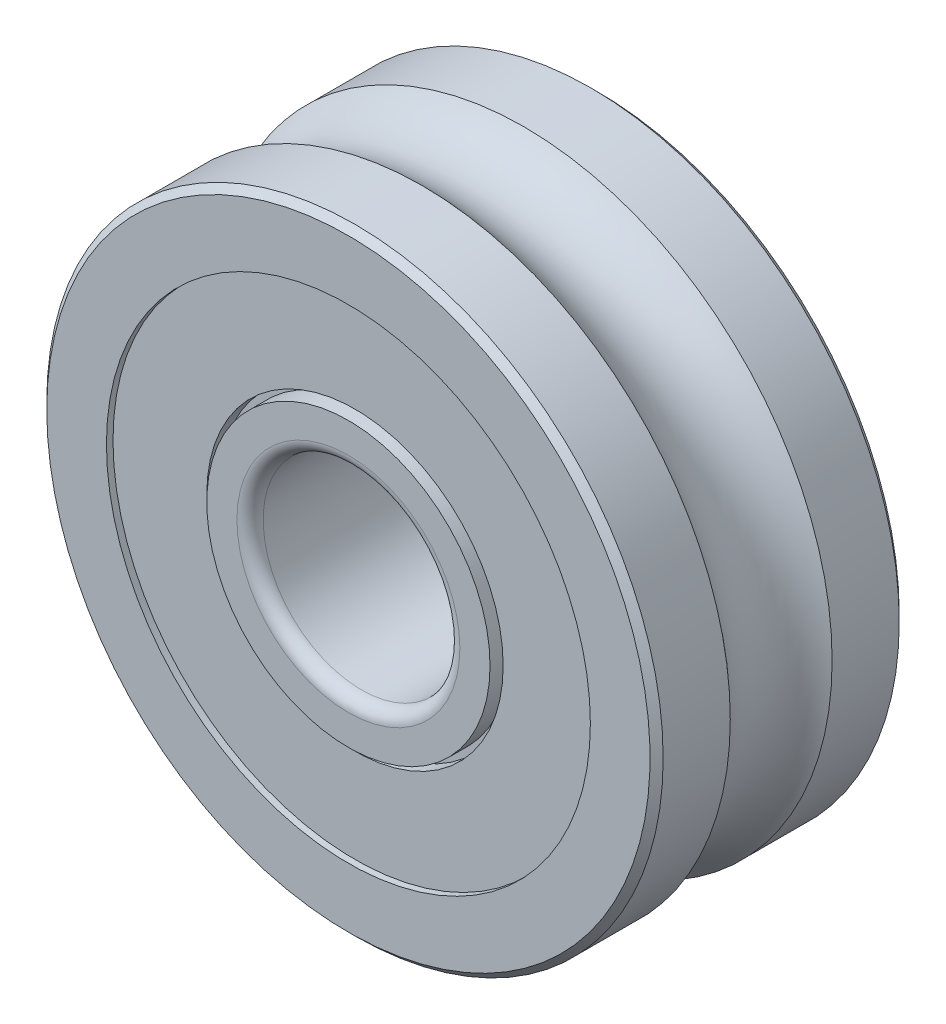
ISO-10303-21;
HEADER;
FILE_DESCRIPTION(('STEP AP214'),'2;1');
FILE_NAME('part.step','',(''),(''),'','','');
FILE_SCHEMA(('AUTOMOTIVE_DESIGN { 1 0 10303 214 1 1 1 1 }'));
ENDSEC;
DATA;
#1=APPLICATION_CONTEXT('core data for automotive mechanical design processes');
#2=APPLICATION_PROTOCOL_DEFINITION('international standard','automotive_design',2000,#1);
#3=PRODUCT_CONTEXT('',#1,'mechanical');
#4=PRODUCT('Part','Part','',(#3));
#5=PRODUCT_RELATED_PRODUCT_CATEGORY('part','',(#4));
#6=PRODUCT_DEFINITION_FORMATION('','',#4);
#7=PRODUCT_DEFINITION_CONTEXT('part definition',#1,'design');
#8=PRODUCT_DEFINITION('design','',#6,#7);
#9=PRODUCT_DEFINITION_SHAPE('','',#8);
#10=(LENGTH_UNIT() NAMED_UNIT(*) SI_UNIT(.MILLI.,.METRE.));
#11=(NAMED_UNIT(*) PLANE_ANGLE_UNIT() SI_UNIT($,.RADIAN.));
#12=(NAMED_UNIT(*) SI_UNIT($,.STERADIAN.) SOLID_ANGLE_UNIT());
#13=UNCERTAINTY_MEASURE_WITH_UNIT(LENGTH_MEASURE(1.E-05),#10,'distance_accuracy_value','');
#14=(GEOMETRIC_REPRESENTATION_CONTEXT(3) GLOBAL_UNCERTAINTY_ASSIGNED_CONTEXT((#13)) GLOBAL_UNIT_ASSIGNED_CONTEXT((#10,
#11,#12)) REPRESENTATION_CONTEXT('',''));
#15=CARTESIAN_POINT('',(0.,0.,0.));
#16=DIRECTION('',(0.,0.,1.));
#17=DIRECTION('',(1.,0.,0.));
#18=AXIS2_PLACEMENT_3D('',#15,#16,#17);
#19=CARTESIAN_POINT('',(0.,0.,38.6779652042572));
#20=DIRECTION('',(0.,0.,1.));
#21=DIRECTION('',(1.,0.,0.));
#22=AXIS2_PLACEMENT_3D('',#19,#20,#21);
#23=CYLINDRICAL_SURFACE('',#22,11.3);
#24=CARTESIAN_POINT('',(0.,0.,-9.));
#25=DIRECTION('',(0.,0.,1.));
#26=DIRECTION('',(1.,0.,0.));
#27=AXIS2_PLACEMENT_3D('',#24,#25,#26);
#28=CIRCLE('',#27,11.3);
#29=CARTESIAN_POINT('',(11.3,0.,-9.));
#30=VERTEX_POINT('',#29);
#31=EDGE_CURVE('E198',#30,#30,#28,.F.);
#32=ORIENTED_EDGE('',*,*,#31,.T.);
#33=EDGE_LOOP('',(#32));
#34=FACE_BOUND('',#33,.T.);
#35=CARTESIAN_POINT('',(0.,0.,-8.));
#36=DIRECTION('',(0.,0.,1.));
#37=DIRECTION('',(1.,0.,0.));
#38=AXIS2_PLACEMENT_3D('',#35,#36,#37);
#39=CIRCLE('',#38,11.3);
#40=CARTESIAN_POINT('',(11.3,0.,-8.));
#41=VERTEX_POINT('',#40);
#42=EDGE_CURVE('E201',#41,#41,#39,.T.);
#43=ORIENTED_EDGE('',*,*,#42,.T.);
#44=EDGE_LOOP('',(#43));
#45=FACE_BOUND('',#44,.T.);
#46=ADVANCED_FACE('F14',(#34,#45),#23,.F.);
#47=CARTESIAN_POINT('',(0.,18.45,-9.));
#48=DIRECTION('',(0.,0.,1.));
#49=DIRECTION('',(1.,0.,0.));
#50=AXIS2_PLACEMENT_3D('',#47,#48,#49);
#51=PLANE('',#50);
#52=ORIENTED_EDGE('',*,*,#31,.F.);
#53=EDGE_LOOP('',(#52));
#54=FACE_BOUND('',#53,.T.);
#55=CARTESIAN_POINT('',(0.,0.,-9.));
#56=DIRECTION('',(0.,0.,1.));
#57=DIRECTION('',(1.,0.,0.));
#58=AXIS2_PLACEMENT_3D('',#55,#56,#57);
#59=CIRCLE('',#58,18.45);
#60=CARTESIAN_POINT('',(18.45,0.,-9.));
#61=VERTEX_POINT('',#60);
#62=EDGE_CURVE('E204',#61,#61,#59,.F.);
#63=ORIENTED_EDGE('',*,*,#62,.T.);
#64=EDGE_LOOP('',(#63));
#65=FACE_BOUND('',#64,.T.);
#66=ADVANCED_FACE('F95',(#54,#65),#51,.F.);
#67=CARTESIAN_POINT('',(0.,10.8,-8.));
#68=DIRECTION('',(0.,0.,1.));
#69=DIRECTION('',(1.,0.,0.));
#70=AXIS2_PLACEMENT_3D('',#67,#68,#69);
#71=PLANE('',#70);
#72=CARTESIAN_POINT('',(0.,0.,-8.));
#73=DIRECTION('',(0.,0.,1.));
#74=DIRECTION('',(1.,0.,0.));
#75=AXIS2_PLACEMENT_3D('',#72,#73,#74);
#76=CIRCLE('',#75,10.8);
#77=CARTESIAN_POINT('',(10.8,0.,-8.));
#78=VERTEX_POINT('',#77);
#79=EDGE_CURVE('E207',#78,#78,#76,.F.);
#80=ORIENTED_EDGE('',*,*,#79,.F.);
#81=EDGE_LOOP('',(#80));
#82=FACE_BOUND('',#81,.T.);
#83=ORIENTED_EDGE('',*,*,#42,.F.);
#84=EDGE_LOOP('',(#83));
#85=FACE_BOUND('',#84,.T.);
#86=ADVANCED_FACE('F92',(#82,#85),#71,.F.);
#87=CARTESIAN_POINT('',(0.,0.,38.6779652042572));
#88=DIRECTION('',(0.,0.,1.));
#89=DIRECTION('',(1.,0.,0.));
#90=AXIS2_PLACEMENT_3D('',#87,#88,#89);
#91=CYLINDRICAL_SURFACE('',#90,18.45);
#92=CARTESIAN_POINT('',(0.,0.,-9.5));
#93=DIRECTION('',(0.,0.,1.));
#94=DIRECTION('',(1.,0.,0.));
#95=AXIS2_PLACEMENT_3D('',#92,#93,#94);
#96=CIRCLE('',#95,18.45);
#97=CARTESIAN_POINT('',(18.45,0.,-9.5));
#98=VERTEX_POINT('',#97);
#99=EDGE_CURVE('E210',#98,#98,#96,.F.);
#100=ORIENTED_EDGE('',*,*,#99,.T.);
#101=EDGE_LOOP('',(#100));
#102=FACE_BOUND('',#101,.T.);
#103=ORIENTED_EDGE('',*,*,#62,.F.);
#104=EDGE_LOOP('',(#103));
#105=FACE_BOUND('',#104,.T.);
#106=ADVANCED_FACE('F88',(#102,#105),#91,.F.);
#107=CARTESIAN_POINT('',(0.,0.,38.6779652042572));
#108=DIRECTION('',(0.,0.,1.));
#109=DIRECTION('',(1.,0.,0.));
#110=AXIS2_PLACEMENT_3D('',#107,#108,#109);
#111=CYLINDRICAL_SURFACE('',#110,10.8);
#112=ORIENTED_EDGE('',*,*,#79,.T.);
#113=EDGE_LOOP('',(#112));
#114=FACE_BOUND('',#113,.T.);
#115=CARTESIAN_POINT('',(0.,0.,-9.5));
#116=DIRECTION('',(0.,0.,1.));
#117=DIRECTION('',(1.,0.,0.));
#118=AXIS2_PLACEMENT_3D('',#115,#116,#117);
#119=CIRCLE('',#118,10.8);
#120=CARTESIAN_POINT('',(10.8,0.,-9.5));
#121=VERTEX_POINT('',#120);
#122=EDGE_CURVE('E213',#121,#121,#119,.T.);
#123=ORIENTED_EDGE('',*,*,#122,.T.);
#124=EDGE_LOOP('',(#123));
#125=FACE_BOUND('',#124,.T.);
#126=ADVANCED_FACE('F84',(#114,#125),#111,.T.);
#127=CARTESIAN_POINT('',(0.,23.,-9.5));
#128=DIRECTION('',(0.,0.,1.));
#129=DIRECTION('',(1.,0.,0.));
#130=AXIS2_PLACEMENT_3D('',#127,#128,#129);
#131=PLANE('',#130);
#132=ORIENTED_EDGE('',*,*,#99,.F.);
#133=EDGE_LOOP('',(#132));
#134=FACE_BOUND('',#133,.T.);
#135=CARTESIAN_POINT('',(0.,0.,-9.5));
#136=DIRECTION('',(0.,0.,1.));
#137=DIRECTION('',(1.,0.,0.));
#138=AXIS2_PLACEMENT_3D('',#135,#136,#137);
#139=CIRCLE('',#138,23.);
#140=CARTESIAN_POINT('',(23.,0.,-9.5));
#141=VERTEX_POINT('',#140);
#142=EDGE_CURVE('E56',#141,#141,#139,.T.);
#143=ORIENTED_EDGE('',*,*,#142,.F.);
#144=EDGE_LOOP('',(#143));
#145=FACE_BOUND('',#144,.T.);
#146=ADVANCED_FACE('F73',(#134,#145),#131,.F.);
#147=CARTESIAN_POINT('',(0.,10.8,-9.5));
#148=DIRECTION('',(0.,0.,1.));
#149=DIRECTION('',(1.,0.,0.));
#150=AXIS2_PLACEMENT_3D('',#147,#148,#149);
#151=PLANE('',#150);
#152=CARTESIAN_POINT('',(0.,0.,-9.5));
#153=DIRECTION('',(0.,0.,-1.));
#154=DIRECTION('',(1.,0.,0.));
#155=AXIS2_PLACEMENT_3D('',#152,#153,#154);
#156=CIRCLE('',#155,8.5);
#157=CARTESIAN_POINT('',(8.5,0.,-9.5));
#158=VERTEX_POINT('',#157);
#159=CARTESIAN_POINT('',(-8.5,0.,-9.5));
#160=VERTEX_POINT('',#159);
#161=EDGE_CURVE('E42',#158,#160,#156,.T.);
#162=ORIENTED_EDGE('',*,*,#161,.F.);
#163=CARTESIAN_POINT('',(0.,0.,-9.5));
#164=DIRECTION('',(0.,0.,-1.));
#165=DIRECTION('',(-1.,0.,0.));
#166=AXIS2_PLACEMENT_3D('',#163,#164,#165);
#167=CIRCLE('',#166,8.5);
#168=EDGE_CURVE('E44',#160,#158,#167,.T.);
#169=ORIENTED_EDGE('',*,*,#168,.F.);
#170=EDGE_LOOP('',(#162,#169));
#171=FACE_BOUND('',#170,.T.);
#172=ORIENTED_EDGE('',*,*,#122,.F.);
#173=EDGE_LOOP('',(#172));
#174=FACE_BOUND('',#173,.T.);
#175=ADVANCED_FACE('F54',(#171,#174),#151,.F.);
#176=CARTESIAN_POINT('',(0.,0.,-9.));
#177=DIRECTION('',(0.,0.,1.));
#178=DIRECTION('',(1.,0.,0.));
#179=AXIS2_PLACEMENT_3D('',#176,#177,#178);
#180=CONICAL_SURFACE('',#179,23.5,0.785398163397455);
#181=ORIENTED_EDGE('',*,*,#142,.T.);
#182=EDGE_LOOP('',(#181));
#183=FACE_BOUND('',#182,.T.);
#184=CARTESIAN_POINT('',(0.,0.,-9.));
#185=DIRECTION('',(0.,0.,1.));
#186=DIRECTION('',(1.,0.,0.));
#187=AXIS2_PLACEMENT_3D('',#184,#185,#186);
#188=CIRCLE('',#187,23.5);
#189=CARTESIAN_POINT('',(23.5,0.,-9.));
#190=VERTEX_POINT('',#189);
#191=EDGE_CURVE('E50',#190,#190,#188,.T.);
#192=ORIENTED_EDGE('',*,*,#191,.F.);
#193=EDGE_LOOP('',(#192));
#194=FACE_BOUND('',#193,.T.);
#195=ADVANCED_FACE('F72',(#183,#194),#180,.T.);
#196=CARTESIAN_POINT('',(0.,0.,-8.5));
#197=DIRECTION('',(0.,0.,1.));
#198=DIRECTION('',(1.,0.,0.));
#199=AXIS2_PLACEMENT_3D('',#196,#197,#198);
#200=TOROIDAL_SURFACE('',#199,8.5,1.);
#201=ORIENTED_EDGE('',*,*,#161,.T.);
#202=ORIENTED_EDGE('',*,*,#168,.T.);
#203=EDGE_LOOP('',(#201,#202));
#204=FACE_BOUND('',#203,.T.);
#205=CARTESIAN_POINT('',(0.,0.,-8.5));
#206=DIRECTION('',(0.,0.,1.));
#207=DIRECTION('',(1.,0.,0.));
#208=AXIS2_PLACEMENT_3D('',#205,#206,#207);
#209=CIRCLE('',#208,7.5);
#210=CARTESIAN_POINT('',(7.5,0.,-8.5));
#211=VERTEX_POINT('',#210);
#212=EDGE_CURVE('E247',#211,#211,#209,.T.);
#213=ORIENTED_EDGE('',*,*,#212,.T.);
#214=EDGE_LOOP('',(#213));
#215=FACE_BOUND('',#214,.T.);
#216=ADVANCED_FACE('F46',(#204,#215),#200,.T.);
#217=CARTESIAN_POINT('',(0.,0.,38.6779652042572));
#218=DIRECTION('',(0.,0.,1.));
#219=DIRECTION('',(1.,0.,0.));
#220=AXIS2_PLACEMENT_3D('',#217,#218,#219);
#221=CYLINDRICAL_SURFACE('',#220,23.5);
#222=ORIENTED_EDGE('',*,*,#191,.T.);
#223=EDGE_LOOP('',(#222));
#224=FACE_BOUND('',#223,.T.);
#225=CARTESIAN_POINT('',(0.,0.,-3.88297566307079));
#226=DIRECTION('',(0.,0.,1.));
#227=DIRECTION('',(1.,0.,0.));
#228=AXIS2_PLACEMENT_3D('',#225,#226,#227);
#229=CIRCLE('',#228,23.5);
#230=CARTESIAN_POINT('',(23.5,0.,-3.88297566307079));
#231=VERTEX_POINT('',#230);
#232=EDGE_CURVE('E250',#231,#231,#229,.F.);
#233=ORIENTED_EDGE('',*,*,#232,.T.);
#234=EDGE_LOOP('',(#233));
#235=FACE_BOUND('',#234,.T.);
#236=ADVANCED_FACE('F243',(#224,#235),#221,.T.);
#237=CARTESIAN_POINT('',(0.,0.,38.6779652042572));
#238=DIRECTION('',(0.,0.,1.));
#239=DIRECTION('',(1.,0.,0.));
#240=AXIS2_PLACEMENT_3D('',#237,#238,#239);
#241=CYLINDRICAL_SURFACE('',#240,7.5);
#242=ORIENTED_EDGE('',*,*,#212,.F.);
#243=EDGE_LOOP('',(#242));
#244=FACE_BOUND('',#243,.T.);
#245=CARTESIAN_POINT('',(0.,0.,8.5));
#246=DIRECTION('',(0.,0.,1.));
#247=DIRECTION('',(1.,0.,0.));
#248=AXIS2_PLACEMENT_3D('',#245,#246,#247);
#249=CIRCLE('',#248,7.5);
#250=CARTESIAN_POINT('',(7.5,0.,8.5));
#251=VERTEX_POINT('',#250);
#252=EDGE_CURVE('E252',#251,#251,#249,.F.);
#253=ORIENTED_EDGE('',*,*,#252,.F.);
#254=EDGE_LOOP('',(#253));
#255=FACE_BOUND('',#254,.T.);
#256=ADVANCED_FACE('F179',(#244,#255),#241,.F.);
#257=CARTESIAN_POINT('',(0.,0.,8.5));
#258=DIRECTION('',(0.,0.,1.));
#259=DIRECTION('',(1.,0.,0.));
#260=AXIS2_PLACEMENT_3D('',#257,#258,#259);
#261=TOROIDAL_SURFACE('',#260,8.5,1.);
#262=ORIENTED_EDGE('',*,*,#252,.T.);
#263=EDGE_LOOP('',(#262));
#264=FACE_BOUND('',#263,.T.);
#265=CARTESIAN_POINT('',(0.,0.,9.5));
#266=DIRECTION('',(0.,0.,1.));
#267=DIRECTION('',(1.,0.,0.));
#268=AXIS2_PLACEMENT_3D('',#265,#266,#267);
#269=CIRCLE('',#268,8.5);
#270=CARTESIAN_POINT('',(8.5,0.,9.5));
#271=VERTEX_POINT('',#270);
#272=CARTESIAN_POINT('',(-8.5,0.,9.5));
#273=VERTEX_POINT('',#272);
#274=EDGE_CURVE('E33',#271,#273,#269,.T.);
#275=ORIENTED_EDGE('',*,*,#274,.T.);
#276=CARTESIAN_POINT('',(0.,0.,9.5));
#277=DIRECTION('',(0.,0.,1.));
#278=DIRECTION('',(-1.,0.,0.));
#279=AXIS2_PLACEMENT_3D('',#276,#277,#278);
#280=CIRCLE('',#279,8.5);
#281=EDGE_CURVE('E197',#273,#271,#280,.T.);
#282=ORIENTED_EDGE('',*,*,#281,.T.);
#283=EDGE_LOOP('',(#275,#282));
#284=FACE_BOUND('',#283,.T.);
#285=ADVANCED_FACE('F175',(#264,#284),#261,.T.);
#286=CARTESIAN_POINT('',(0.,0.,0.));
#287=DIRECTION('',(0.,0.,1.));
#288=DIRECTION('',(1.,0.,0.));
#289=AXIS2_PLACEMENT_3D('',#286,#287,#288);
#290=TOROIDAL_SURFACE('',#289,26.65,5.);
#291=ORIENTED_EDGE('',*,*,#232,.F.);
#292=EDGE_LOOP('',(#291));
#293=FACE_BOUND('',#292,.T.);
#294=CARTESIAN_POINT('',(0.,0.,3.88297566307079));
#295=DIRECTION('',(0.,0.,1.));
#296=DIRECTION('',(1.,0.,0.));
#297=AXIS2_PLACEMENT_3D('',#294,#295,#296);
#298=CIRCLE('',#297,23.5);
#299=CARTESIAN_POINT('',(23.5,0.,3.88297566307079));
#300=VERTEX_POINT('',#299);
#301=EDGE_CURVE('E162',#300,#300,#298,.T.);
#302=ORIENTED_EDGE('',*,*,#301,.F.);
#303=EDGE_LOOP('',(#302));
#304=FACE_BOUND('',#303,.T.);
#305=ADVANCED_FACE('F149',(#293,#304),#290,.F.);
#306=CARTESIAN_POINT('',(0.,10.8,9.5));
#307=DIRECTION('',(0.,0.,-1.));
#308=DIRECTION('',(-1.,0.,0.));
#309=AXIS2_PLACEMENT_3D('',#306,#307,#308);
#310=PLANE('',#309);
#311=CARTESIAN_POINT('',(0.,0.,9.5));
#312=DIRECTION('',(0.,0.,1.));
#313=DIRECTION('',(1.,0.,0.));
#314=AXIS2_PLACEMENT_3D('',#311,#312,#313);
#315=CIRCLE('',#314,10.8);
#316=CARTESIAN_POINT('',(10.8,0.,9.5));
#317=VERTEX_POINT('',#316);
#318=EDGE_CURVE('E169',#317,#317,#315,.F.);
#319=ORIENTED_EDGE('',*,*,#318,.F.);
#320=EDGE_LOOP('',(#319));
#321=FACE_BOUND('',#320,.T.);
#322=ORIENTED_EDGE('',*,*,#281,.F.);
#323=ORIENTED_EDGE('',*,*,#274,.F.);
#324=EDGE_LOOP('',(#322,#323));
#325=FACE_BOUND('',#324,.T.);
#326=ADVANCED_FACE('F144',(#321,#325),#310,.F.);
#327=CARTESIAN_POINT('',(0.,0.,38.6779652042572));
#328=DIRECTION('',(0.,0.,1.));
#329=DIRECTION('',(1.,0.,0.));
#330=AXIS2_PLACEMENT_3D('',#327,#328,#329);
#331=CYLINDRICAL_SURFACE('',#330,23.5);
#332=ORIENTED_EDGE('',*,*,#301,.T.);
#333=EDGE_LOOP('',(#332));
#334=FACE_BOUND('',#333,.T.);
#335=CARTESIAN_POINT('',(0.,0.,9.));
#336=DIRECTION('',(0.,0.,-1.));
#337=DIRECTION('',(-1.,0.,0.));
#338=AXIS2_PLACEMENT_3D('',#335,#336,#337);
#339=CIRCLE('',#338,23.5);
#340=CARTESIAN_POINT('',(-23.5,0.,9.));
#341=VERTEX_POINT('',#340);
#342=EDGE_CURVE('E220',#341,#341,#339,.F.);
#343=ORIENTED_EDGE('',*,*,#342,.F.);
#344=EDGE_LOOP('',(#343));
#345=FACE_BOUND('',#344,.T.);
#346=ADVANCED_FACE('F140',(#334,#345),#331,.T.);
#347=CARTESIAN_POINT('',(0.,0.,38.6779652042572));
#348=DIRECTION('',(0.,0.,1.));
#349=DIRECTION('',(1.,0.,0.));
#350=AXIS2_PLACEMENT_3D('',#347,#348,#349);
#351=CYLINDRICAL_SURFACE('',#350,10.8);
#352=ORIENTED_EDGE('',*,*,#318,.T.);
#353=EDGE_LOOP('',(#352));
#354=FACE_BOUND('',#353,.T.);
#355=CARTESIAN_POINT('',(0.,0.,8.));
#356=DIRECTION('',(0.,0.,1.));
#357=DIRECTION('',(1.,0.,0.));
#358=AXIS2_PLACEMENT_3D('',#355,#356,#357);
#359=CIRCLE('',#358,10.8);
#360=CARTESIAN_POINT('',(10.8,0.,8.));
#361=VERTEX_POINT('',#360);
#362=EDGE_CURVE('E221',#361,#361,#359,.T.);
#363=ORIENTED_EDGE('',*,*,#362,.T.);
#364=EDGE_LOOP('',(#363));
#365=FACE_BOUND('',#364,.T.);
#366=ADVANCED_FACE('F136',(#354,#365),#351,.T.);
#367=CARTESIAN_POINT('',(0.,0.,9.));
#368=DIRECTION('',(0.,0.,-1.));
#369=DIRECTION('',(-1.,0.,0.));
#370=AXIS2_PLACEMENT_3D('',#367,#368,#369);
#371=CONICAL_SURFACE('',#370,23.5,0.785398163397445);
#372=CARTESIAN_POINT('',(0.,0.,9.5));
#373=DIRECTION('',(0.,0.,-1.));
#374=DIRECTION('',(-1.,0.,0.));
#375=AXIS2_PLACEMENT_3D('',#372,#373,#374);
#376=CIRCLE('',#375,23.);
#377=CARTESIAN_POINT('',(-23.,0.,9.5));
#378=VERTEX_POINT('',#377);
#379=EDGE_CURVE('E224',#378,#378,#376,.T.);
#380=ORIENTED_EDGE('',*,*,#379,.T.);
#381=EDGE_LOOP('',(#380));
#382=FACE_BOUND('',#381,.T.);
#383=ORIENTED_EDGE('',*,*,#342,.T.);
#384=EDGE_LOOP('',(#383));
#385=FACE_BOUND('',#384,.T.);
#386=ADVANCED_FACE('F132',(#382,#385),#371,.T.);
#387=CARTESIAN_POINT('',(0.,10.8,8.));
#388=DIRECTION('',(0.,0.,-1.));
#389=DIRECTION('',(-1.,0.,0.));
#390=AXIS2_PLACEMENT_3D('',#387,#388,#389);
#391=PLANE('',#390);
#392=CARTESIAN_POINT('',(0.,0.,8.));
#393=DIRECTION('',(0.,0.,1.));
#394=DIRECTION('',(1.,0.,0.));
#395=AXIS2_PLACEMENT_3D('',#392,#393,#394);
#396=CIRCLE('',#395,11.3);
#397=CARTESIAN_POINT('',(11.3,0.,8.));
#398=VERTEX_POINT('',#397);
#399=EDGE_CURVE('E227',#398,#398,#396,.T.);
#400=ORIENTED_EDGE('',*,*,#399,.T.);
#401=EDGE_LOOP('',(#400));
#402=FACE_BOUND('',#401,.T.);
#403=ORIENTED_EDGE('',*,*,#362,.F.);
#404=EDGE_LOOP('',(#403));
#405=FACE_BOUND('',#404,.T.);
#406=ADVANCED_FACE('F128',(#402,#405),#391,.F.);
#407=CARTESIAN_POINT('',(0.,23.,9.5));
#408=DIRECTION('',(0.,0.,-1.));
#409=DIRECTION('',(-1.,0.,0.));
#410=AXIS2_PLACEMENT_3D('',#407,#408,#409);
#411=PLANE('',#410);
#412=ORIENTED_EDGE('',*,*,#379,.F.);
#413=EDGE_LOOP('',(#412));
#414=FACE_BOUND('',#413,.T.);
#415=CARTESIAN_POINT('',(0.,0.,9.5));
#416=DIRECTION('',(0.,0.,1.));
#417=DIRECTION('',(1.,0.,0.));
#418=AXIS2_PLACEMENT_3D('',#415,#416,#417);
#419=CIRCLE('',#418,18.45);
#420=CARTESIAN_POINT('',(18.45,0.,9.5));
#421=VERTEX_POINT('',#420);
#422=EDGE_CURVE('E230',#421,#421,#419,.F.);
#423=ORIENTED_EDGE('',*,*,#422,.T.);
#424=EDGE_LOOP('',(#423));
#425=FACE_BOUND('',#424,.T.);
#426=ADVANCED_FACE('F124',(#414,#425),#411,.F.);
#427=CARTESIAN_POINT('',(0.,0.,38.6779652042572));
#428=DIRECTION('',(0.,0.,1.));
#429=DIRECTION('',(1.,0.,0.));
#430=AXIS2_PLACEMENT_3D('',#427,#428,#429);
#431=CYLINDRICAL_SURFACE('',#430,11.3);
#432=ORIENTED_EDGE('',*,*,#399,.F.);
#433=EDGE_LOOP('',(#432));
#434=FACE_BOUND('',#433,.T.);
#435=CARTESIAN_POINT('',(0.,0.,9.));
#436=DIRECTION('',(0.,0.,1.));
#437=DIRECTION('',(1.,0.,0.));
#438=AXIS2_PLACEMENT_3D('',#435,#436,#437);
#439=CIRCLE('',#438,11.3);
#440=CARTESIAN_POINT('',(11.3,0.,9.));
#441=VERTEX_POINT('',#440);
#442=EDGE_CURVE('E25',#441,#441,#439,.T.);
#443=ORIENTED_EDGE('',*,*,#442,.T.);
#444=EDGE_LOOP('',(#443));
#445=FACE_BOUND('',#444,.T.);
#446=ADVANCED_FACE('F116',(#434,#445),#431,.F.);
#447=CARTESIAN_POINT('',(0.,0.,38.6779652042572));
#448=DIRECTION('',(0.,0.,1.));
#449=DIRECTION('',(1.,0.,0.));
#450=AXIS2_PLACEMENT_3D('',#447,#448,#449);
#451=CYLINDRICAL_SURFACE('',#450,18.45);
#452=CARTESIAN_POINT('',(0.,0.,9.));
#453=DIRECTION('',(0.,0.,1.));
#454=DIRECTION('',(1.,0.,0.));
#455=AXIS2_PLACEMENT_3D('',#452,#453,#454);
#456=CIRCLE('',#455,18.45);
#457=CARTESIAN_POINT('',(18.45,0.,9.));
#458=VERTEX_POINT('',#457);
#459=EDGE_CURVE('E9',#458,#458,#456,.F.);
#460=ORIENTED_EDGE('',*,*,#459,.T.);
#461=EDGE_LOOP('',(#460));
#462=FACE_BOUND('',#461,.T.);
#463=ORIENTED_EDGE('',*,*,#422,.F.);
#464=EDGE_LOOP('',(#463));
#465=FACE_BOUND('',#464,.T.);
#466=ADVANCED_FACE('F109',(#462,#465),#451,.F.);
#467=CARTESIAN_POINT('',(0.,18.45,9.));
#468=DIRECTION('',(0.,0.,-1.));
#469=DIRECTION('',(-1.,0.,0.));
#470=AXIS2_PLACEMENT_3D('',#467,#468,#469);
#471=PLANE('',#470);
#472=ORIENTED_EDGE('',*,*,#459,.F.);
#473=EDGE_LOOP('',(#472));
#474=FACE_BOUND('',#473,.T.);
#475=ORIENTED_EDGE('',*,*,#442,.F.);
#476=EDGE_LOOP('',(#475));
#477=FACE_BOUND('',#476,.T.);
#478=ADVANCED_FACE('F107',(#474,#477),#471,.F.);
#479=CLOSED_SHELL('',(#46,#66,#86,#106,#126,#146,#175,#195,#216,#236,#256,#285,#305,#326,#346,
#366,#386,#406,#426,#446,#466,#478));
#480=MANIFOLD_SOLID_BREP('B1',#479);
#481=ADVANCED_BREP_SHAPE_REPRESENTATION('',(#18,#480),#14);
#482=SHAPE_DEFINITION_REPRESENTATION(#9,#481);
ENDSEC;
END-ISO-10303-21;
